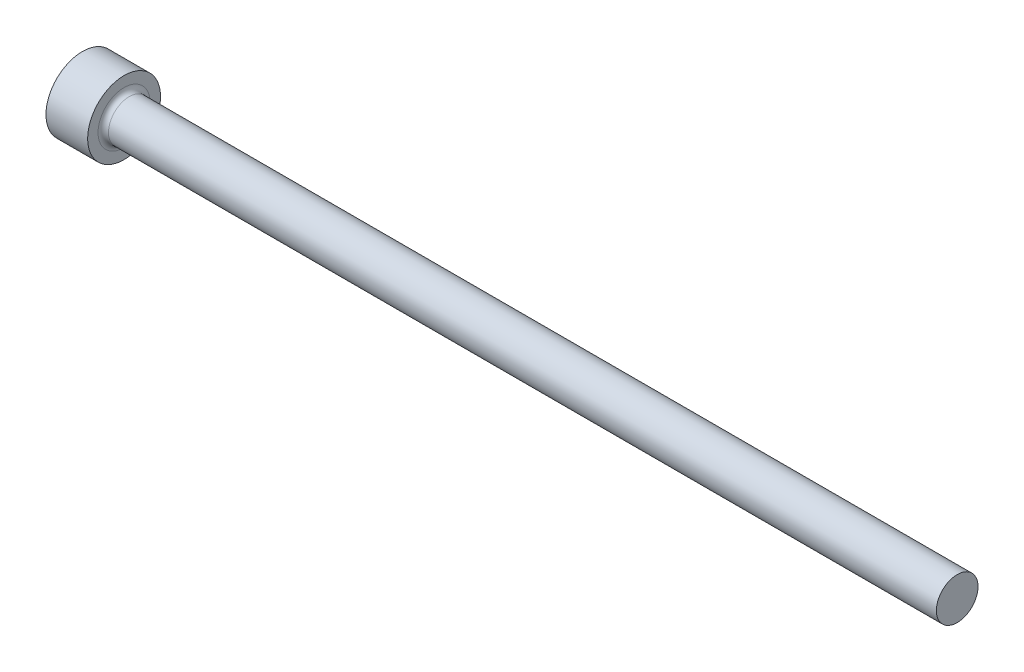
ISO-10303-21;
HEADER;
FILE_DESCRIPTION(('STEP AP214'),'2;1');
FILE_NAME('part.step','',(''),(''),'','','');
FILE_SCHEMA(('AUTOMOTIVE_DESIGN { 1 0 10303 214 1 1 1 1 }'));
ENDSEC;
DATA;
#1=APPLICATION_CONTEXT('core data for automotive mechanical design processes');
#2=APPLICATION_PROTOCOL_DEFINITION('international standard','automotive_design',2000,#1);
#3=PRODUCT_CONTEXT('',#1,'mechanical');
#4=PRODUCT('Part','Part','',(#3));
#5=PRODUCT_RELATED_PRODUCT_CATEGORY('part','',(#4));
#6=PRODUCT_DEFINITION_FORMATION('','',#4);
#7=PRODUCT_DEFINITION_CONTEXT('part definition',#1,'design');
#8=PRODUCT_DEFINITION('design','',#6,#7);
#9=PRODUCT_DEFINITION_SHAPE('','',#8);
#10=(LENGTH_UNIT() NAMED_UNIT(*) SI_UNIT(.MILLI.,.METRE.));
#11=(NAMED_UNIT(*) PLANE_ANGLE_UNIT() SI_UNIT($,.RADIAN.));
#12=(NAMED_UNIT(*) SI_UNIT($,.STERADIAN.) SOLID_ANGLE_UNIT());
#13=UNCERTAINTY_MEASURE_WITH_UNIT(LENGTH_MEASURE(1.E-05),#10,'distance_accuracy_value','');
#14=(GEOMETRIC_REPRESENTATION_CONTEXT(3) GLOBAL_UNCERTAINTY_ASSIGNED_CONTEXT((#13)) GLOBAL_UNIT_ASSIGNED_CONTEXT((#10,
#11,#12)) REPRESENTATION_CONTEXT('',''));
#15=CARTESIAN_POINT('',(0.,0.,0.));
#16=DIRECTION('',(0.,0.,1.));
#17=DIRECTION('',(1.,0.,0.));
#18=AXIS2_PLACEMENT_3D('',#15,#16,#17);
#19=CARTESIAN_POINT('',(127.,3.17499999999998,0.));
#20=DIRECTION('',(-1.,0.,0.));
#21=DIRECTION('',(0.,-1.,0.));
#22=AXIS2_PLACEMENT_3D('',#19,#20,#21);
#23=PLANE('',#22);
#24=CARTESIAN_POINT('',(127.,0.,0.));
#25=DIRECTION('',(1.,0.,0.));
#26=DIRECTION('',(0.,1.,0.));
#27=AXIS2_PLACEMENT_3D('',#24,#25,#26);
#28=CIRCLE('',#27,3.175);
#29=CARTESIAN_POINT('',(127.,3.17499999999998,0.));
#30=VERTEX_POINT('',#29);
#31=EDGE_CURVE('E10',#30,#30,#28,.T.);
#32=ORIENTED_EDGE('',*,*,#31,.T.);
#33=EDGE_LOOP('',(#32));
#34=FACE_BOUND('',#33,.T.);
#35=ADVANCED_FACE('F30',(#34),#23,.F.);
#36=CARTESIAN_POINT('',(127.,0.,0.));
#37=DIRECTION('',(1.,0.,0.));
#38=DIRECTION('',(0.,1.,0.));
#39=AXIS2_PLACEMENT_3D('',#36,#37,#38);
#40=CYLINDRICAL_SURFACE('',#39,3.17499999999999);
#41=ORIENTED_EDGE('',*,*,#31,.F.);
#42=EDGE_LOOP('',(#41));
#43=FACE_BOUND('',#42,.T.);
#44=CARTESIAN_POINT('',(0.79375000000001,0.,0.));
#45=DIRECTION('',(1.,0.,0.));
#46=DIRECTION('',(0.,1.,0.));
#47=AXIS2_PLACEMENT_3D('',#44,#45,#46);
#48=CIRCLE('',#47,3.17499999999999);
#49=CARTESIAN_POINT('',(0.79375000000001,3.17499999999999,0.));
#50=VERTEX_POINT('',#49);
#51=EDGE_CURVE('E36',#50,#50,#48,.T.);
#52=ORIENTED_EDGE('',*,*,#51,.T.);
#53=EDGE_LOOP('',(#52));
#54=FACE_BOUND('',#53,.T.);
#55=ADVANCED_FACE('F65',(#43,#54),#40,.T.);
#56=CARTESIAN_POINT('',(0.793750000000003,0.,0.));
#57=DIRECTION('',(1.,0.,0.));
#58=DIRECTION('',(0.,1.,0.));
#59=AXIS2_PLACEMENT_3D('',#56,#57,#58);
#60=TOROIDAL_SURFACE('',#59,3.96874999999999,0.793750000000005);
#61=ORIENTED_EDGE('',*,*,#51,.F.);
#62=EDGE_LOOP('',(#61));
#63=FACE_BOUND('',#62,.T.);
#64=CARTESIAN_POINT('',(0.,0.,0.));
#65=DIRECTION('',(1.,0.,0.));
#66=DIRECTION('',(0.,1.,0.));
#67=AXIS2_PLACEMENT_3D('',#64,#65,#66);
#68=CIRCLE('',#67,3.96874999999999);
#69=CARTESIAN_POINT('',(0.,3.96874999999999,0.));
#70=VERTEX_POINT('',#69);
#71=EDGE_CURVE('E40',#70,#70,#68,.T.);
#72=ORIENTED_EDGE('',*,*,#71,.T.);
#73=EDGE_LOOP('',(#72));
#74=FACE_BOUND('',#73,.T.);
#75=ADVANCED_FACE('F69',(#63,#74),#60,.F.);
#76=CARTESIAN_POINT('',(0.,5.55625,0.));
#77=DIRECTION('',(-1.,0.,0.));
#78=DIRECTION('',(0.,-1.,0.));
#79=AXIS2_PLACEMENT_3D('',#76,#77,#78);
#80=PLANE('',#79);
#81=ORIENTED_EDGE('',*,*,#71,.F.);
#82=EDGE_LOOP('',(#81));
#83=FACE_BOUND('',#82,.T.);
#84=CARTESIAN_POINT('',(0.,0.,0.));
#85=DIRECTION('',(1.,0.,0.));
#86=DIRECTION('',(0.,1.,0.));
#87=AXIS2_PLACEMENT_3D('',#84,#85,#86);
#88=CIRCLE('',#87,5.55625);
#89=CARTESIAN_POINT('',(0.,5.55625,0.));
#90=VERTEX_POINT('',#89);
#91=EDGE_CURVE('E44',#90,#90,#88,.T.);
#92=ORIENTED_EDGE('',*,*,#91,.T.);
#93=EDGE_LOOP('',(#92));
#94=FACE_BOUND('',#93,.T.);
#95=ADVANCED_FACE('F61',(#83,#94),#80,.F.);
#96=CARTESIAN_POINT('',(127.,0.,0.));
#97=DIRECTION('',(1.,0.,0.));
#98=DIRECTION('',(0.,1.,0.));
#99=AXIS2_PLACEMENT_3D('',#96,#97,#98);
#100=CYLINDRICAL_SURFACE('',#99,5.55625);
#101=ORIENTED_EDGE('',*,*,#91,.F.);
#102=EDGE_LOOP('',(#101));
#103=FACE_BOUND('',#102,.T.);
#104=CARTESIAN_POINT('',(-6.34999999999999,0.,0.));
#105=DIRECTION('',(1.,0.,0.));
#106=DIRECTION('',(0.,1.,0.));
#107=AXIS2_PLACEMENT_3D('',#104,#105,#106);
#108=CIRCLE('',#107,5.55625);
#109=CARTESIAN_POINT('',(-6.34999999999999,5.55625,0.));
#110=VERTEX_POINT('',#109);
#111=EDGE_CURVE('E49',#110,#110,#108,.T.);
#112=ORIENTED_EDGE('',*,*,#111,.T.);
#113=EDGE_LOOP('',(#112));
#114=FACE_BOUND('',#113,.T.);
#115=ADVANCED_FACE('F53',(#103,#114),#100,.T.);
#116=CARTESIAN_POINT('',(-6.35,0.,0.));
#117=DIRECTION('',(1.,0.,0.));
#118=DIRECTION('',(0.,1.,0.));
#119=AXIS2_PLACEMENT_3D('',#116,#117,#118);
#120=PLANE('',#119);
#121=ORIENTED_EDGE('',*,*,#111,.F.);
#122=EDGE_LOOP('',(#121));
#123=FACE_BOUND('',#122,.T.);
#124=ADVANCED_FACE('F55',(#123),#120,.F.);
#125=CLOSED_SHELL('',(#35,#55,#75,#95,#115,#124));
#126=MANIFOLD_SOLID_BREP('B2',#125);
#127=ADVANCED_BREP_SHAPE_REPRESENTATION('',(#18,#126),#14);
#128=SHAPE_DEFINITION_REPRESENTATION(#9,#127);
ENDSEC;
END-ISO-10303-21;
